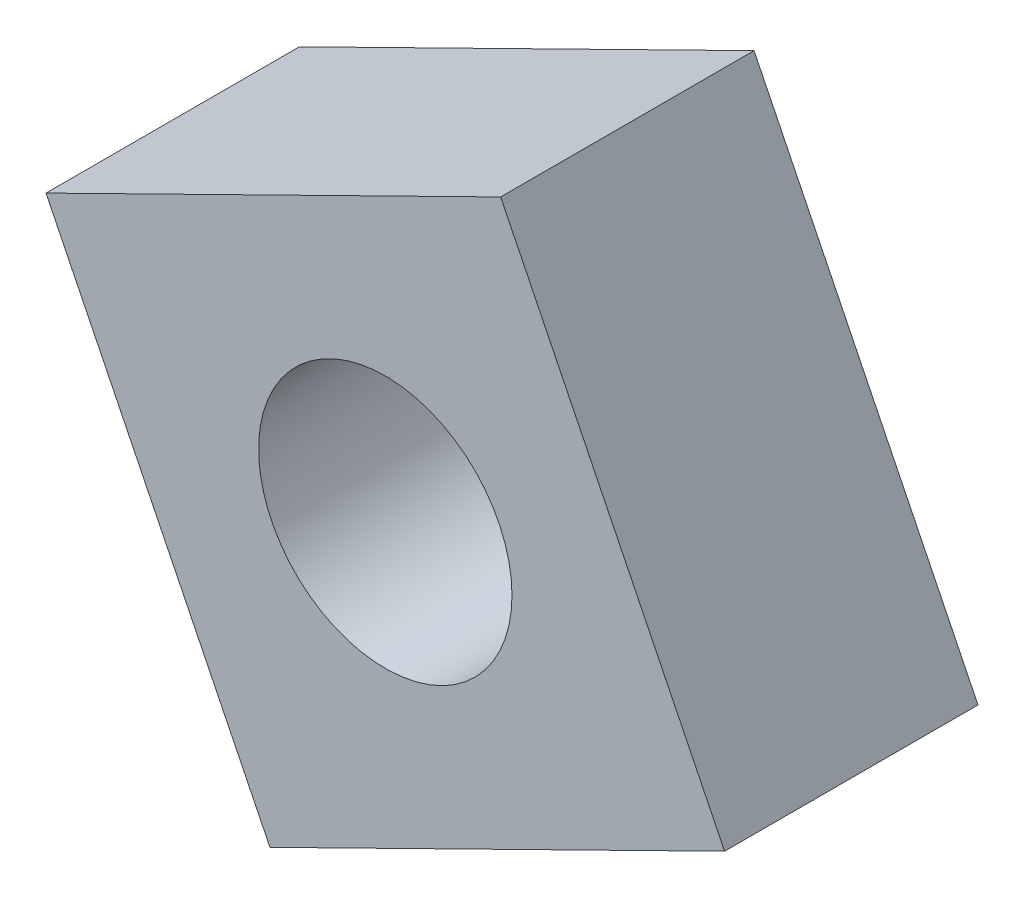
from build123d import *

# Parameters (mm, degrees)
ESQUISSE1_R        = 1
BOSS_EXTRU_1_DEPTH = 2


with BuildPart() as part:
    # Esquisse1 → Boss.-Extru.1 (new body)
    with BuildSketch(Plane.XY):
        Polygon((-2.677921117, 0.910350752), (-0.910350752, -2.677921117), (2.677921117, -0.910350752), (0.910350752, 2.677921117), align=None)
        Circle(ESQUISSE1_R, mode=Mode.SUBTRACT)
    extrude(amount=BOSS_EXTRU_1_DEPTH)


solid = part.part
